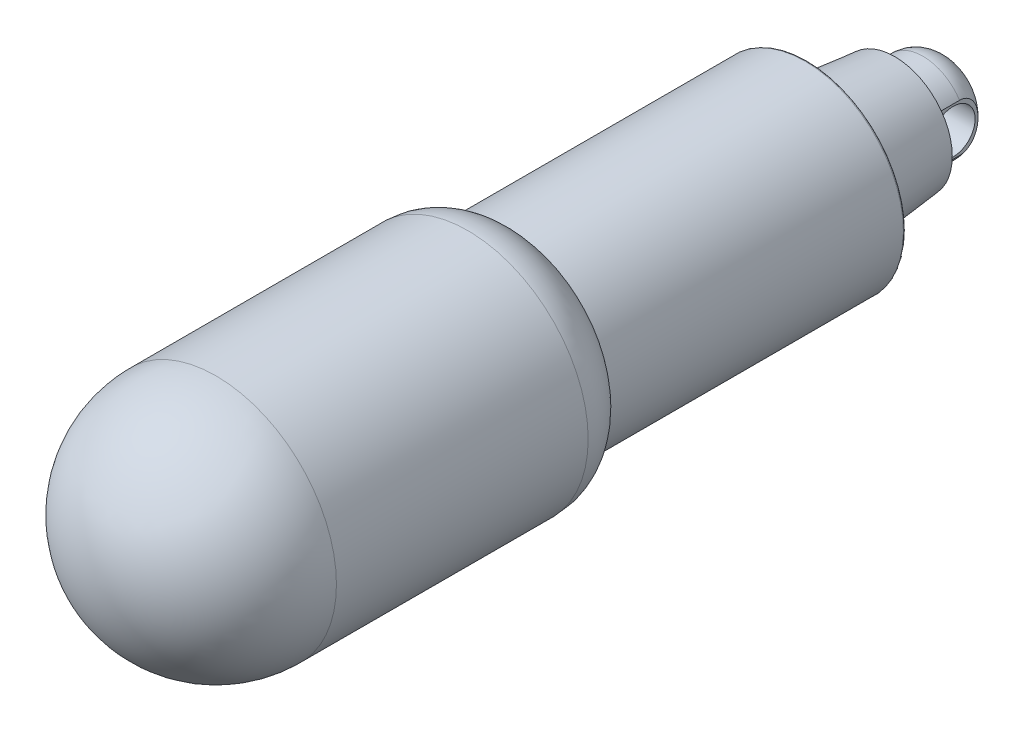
ISO-10303-21;
HEADER;
FILE_DESCRIPTION(('STEP AP214'),'2;1');
FILE_NAME('part.step','',(''),(''),'','','');
FILE_SCHEMA(('AUTOMOTIVE_DESIGN { 1 0 10303 214 1 1 1 1 }'));
ENDSEC;
DATA;
#1=APPLICATION_CONTEXT('core data for automotive mechanical design processes');
#2=APPLICATION_PROTOCOL_DEFINITION('international standard','automotive_design',2000,#1);
#3=PRODUCT_CONTEXT('',#1,'mechanical');
#4=PRODUCT('Part','Part','',(#3));
#5=PRODUCT_RELATED_PRODUCT_CATEGORY('part','',(#4));
#6=PRODUCT_DEFINITION_FORMATION('','',#4);
#7=PRODUCT_DEFINITION_CONTEXT('part definition',#1,'design');
#8=PRODUCT_DEFINITION('design','',#6,#7);
#9=PRODUCT_DEFINITION_SHAPE('','',#8);
#10=(LENGTH_UNIT() NAMED_UNIT(*) SI_UNIT(.MILLI.,.METRE.));
#11=(NAMED_UNIT(*) PLANE_ANGLE_UNIT() SI_UNIT($,.RADIAN.));
#12=(NAMED_UNIT(*) SI_UNIT($,.STERADIAN.) SOLID_ANGLE_UNIT());
#13=UNCERTAINTY_MEASURE_WITH_UNIT(LENGTH_MEASURE(1.E-05),#10,'distance_accuracy_value','');
#14=(GEOMETRIC_REPRESENTATION_CONTEXT(3) GLOBAL_UNCERTAINTY_ASSIGNED_CONTEXT((#13)) GLOBAL_UNIT_ASSIGNED_CONTEXT((#10,
#11,#12)) REPRESENTATION_CONTEXT('',''));
#15=CARTESIAN_POINT('',(0.,0.,0.));
#16=DIRECTION('',(0.,0.,1.));
#17=DIRECTION('',(1.,0.,0.));
#18=AXIS2_PLACEMENT_3D('',#15,#16,#17);
#19=CARTESIAN_POINT('',(0.,0.,64.));
#20=DIRECTION('',(1.,0.,0.));
#21=DIRECTION('',(0.,1.,0.));
#22=AXIS2_PLACEMENT_3D('',#19,#20,#21);
#23=SPHERICAL_SURFACE('',#22,11.);
#24=CARTESIAN_POINT('',(0.,0.,64.));
#25=DIRECTION('',(0.,0.,1.));
#26=DIRECTION('',(0.,1.,0.));
#27=AXIS2_PLACEMENT_3D('',#24,#25,#26);
#28=SPHERICAL_SURFACE('',#27,11.);
#29=CARTESIAN_POINT('',(0.,0.,64.));
#30=DIRECTION('',(0.,0.,1.));
#31=DIRECTION('',(0.,1.,0.));
#32=AXIS2_PLACEMENT_3D('',#29,#30,#31);
#33=CIRCLE('',#32,11.);
#34=CARTESIAN_POINT('',(0.,-11.,64.));
#35=VERTEX_POINT('',#34);
#36=CARTESIAN_POINT('',(11.,0.,64.));
#37=VERTEX_POINT('',#36);
#38=EDGE_CURVE('E9',#35,#37,#33,.T.);
#39=ORIENTED_EDGE('',*,*,#38,.T.);
#40=CARTESIAN_POINT('',(0.,0.,64.));
#41=DIRECTION('',(0.,0.,1.));
#42=DIRECTION('',(0.,1.,0.));
#43=AXIS2_PLACEMENT_3D('',#40,#41,#42);
#44=CIRCLE('',#43,11.);
#45=CARTESIAN_POINT('',(-11.,0.,64.));
#46=VERTEX_POINT('',#45);
#47=EDGE_CURVE('E26',#37,#46,#44,.T.);
#48=ORIENTED_EDGE('',*,*,#47,.T.);
#49=CARTESIAN_POINT('',(0.,0.,64.));
#50=DIRECTION('',(0.,0.,1.));
#51=DIRECTION('',(0.,1.,0.));
#52=AXIS2_PLACEMENT_3D('',#49,#50,#51);
#53=CIRCLE('',#52,11.);
#54=EDGE_CURVE('E322',#46,#35,#53,.T.);
#55=ORIENTED_EDGE('',*,*,#54,.T.);
#56=EDGE_LOOP('',(#39,#48,#55));
#57=FACE_BOUND('',#56,.T.);
#58=ADVANCED_FACE('F14',(#57),#28,.T.);
#59=CARTESIAN_POINT('',(0.,0.,52.5));
#60=DIRECTION('',(0.,0.,-1.));
#61=DIRECTION('',(0.,1.,0.));
#62=AXIS2_PLACEMENT_3D('',#59,#60,#61);
#63=CYLINDRICAL_SURFACE('',#62,11.);
#64=ORIENTED_EDGE('',*,*,#38,.F.);
#65=ORIENTED_EDGE('',*,*,#54,.F.);
#66=ORIENTED_EDGE('',*,*,#47,.F.);
#67=EDGE_LOOP('',(#64,#65,#66));
#68=FACE_BOUND('',#67,.T.);
#69=CARTESIAN_POINT('',(0.,0.,41.));
#70=DIRECTION('',(0.,0.,1.));
#71=DIRECTION('',(0.,1.,0.));
#72=AXIS2_PLACEMENT_3D('',#69,#70,#71);
#73=CIRCLE('',#72,11.);
#74=CARTESIAN_POINT('',(11.,0.,41.));
#75=VERTEX_POINT('',#74);
#76=EDGE_CURVE('E319',#75,#75,#73,.T.);
#77=ORIENTED_EDGE('',*,*,#76,.T.);
#78=EDGE_LOOP('',(#77));
#79=FACE_BOUND('',#78,.T.);
#80=ADVANCED_FACE('F260',(#68,#79),#63,.T.);
#81=CARTESIAN_POINT('',(0.,0.,41.));
#82=DIRECTION('',(0.,0.,1.));
#83=DIRECTION('',(0.707106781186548,0.707106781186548,0.));
#84=AXIS2_PLACEMENT_3D('',#81,#82,#83);
#85=TOROIDAL_SURFACE('',#84,6.,5.);
#86=ORIENTED_EDGE('',*,*,#76,.F.);
#87=EDGE_LOOP('',(#86));
#88=FACE_BOUND('',#87,.T.);
#89=CARTESIAN_POINT('',(0.,0.,37.));
#90=DIRECTION('',(0.,0.,1.));
#91=DIRECTION('',(0.,1.,0.));
#92=AXIS2_PLACEMENT_3D('',#89,#90,#91);
#93=CIRCLE('',#92,9.);
#94=CARTESIAN_POINT('',(0.,-9.,37.));
#95=VERTEX_POINT('',#94);
#96=EDGE_CURVE('E316',#95,#95,#93,.T.);
#97=ORIENTED_EDGE('',*,*,#96,.T.);
#98=EDGE_LOOP('',(#97));
#99=FACE_BOUND('',#98,.T.);
#100=ADVANCED_FACE('F266',(#88,#99),#85,.T.);
#101=CARTESIAN_POINT('',(0.,0.,23.6));
#102=DIRECTION('',(0.,0.,-1.));
#103=DIRECTION('',(0.,1.,0.));
#104=AXIS2_PLACEMENT_3D('',#101,#102,#103);
#105=CYLINDRICAL_SURFACE('',#104,9.);
#106=ORIENTED_EDGE('',*,*,#96,.F.);
#107=EDGE_LOOP('',(#106));
#108=FACE_BOUND('',#107,.T.);
#109=CARTESIAN_POINT('',(0.,0.,10.2));
#110=DIRECTION('',(0.,0.,1.));
#111=DIRECTION('',(0.,1.,0.));
#112=AXIS2_PLACEMENT_3D('',#109,#110,#111);
#113=CIRCLE('',#112,9.);
#114=CARTESIAN_POINT('',(9.,0.,10.2));
#115=VERTEX_POINT('',#114);
#116=EDGE_CURVE('E313',#115,#115,#113,.T.);
#117=ORIENTED_EDGE('',*,*,#116,.T.);
#118=EDGE_LOOP('',(#117));
#119=FACE_BOUND('',#118,.T.);
#120=ADVANCED_FACE('F272',(#108,#119),#105,.T.);
#121=CARTESIAN_POINT('',(0.,0.,10.2));
#122=DIRECTION('',(0.,0.,1.));
#123=DIRECTION('',(0.707106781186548,0.707106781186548,0.));
#124=AXIS2_PLACEMENT_3D('',#121,#122,#123);
#125=TOROIDAL_SURFACE('',#124,8.8,0.2);
#126=ORIENTED_EDGE('',*,*,#116,.F.);
#127=EDGE_LOOP('',(#126));
#128=FACE_BOUND('',#127,.T.);
#129=CARTESIAN_POINT('',(0.,0.,10.));
#130=DIRECTION('',(0.,0.,1.));
#131=DIRECTION('',(0.,1.,0.));
#132=AXIS2_PLACEMENT_3D('',#129,#130,#131);
#133=CIRCLE('',#132,8.8);
#134=CARTESIAN_POINT('',(0.,8.8,10.));
#135=VERTEX_POINT('',#134);
#136=EDGE_CURVE('E308',#135,#135,#133,.T.);
#137=ORIENTED_EDGE('',*,*,#136,.T.);
#138=EDGE_LOOP('',(#137));
#139=FACE_BOUND('',#138,.T.);
#140=ADVANCED_FACE('F276',(#128,#139),#125,.T.);
#141=CARTESIAN_POINT('',(0.,0.,9.5));
#142=DIRECTION('',(0.,0.,-1.));
#143=DIRECTION('',(0.,1.,0.));
#144=AXIS2_PLACEMENT_3D('',#141,#142,#143);
#145=CYLINDRICAL_SURFACE('',#144,7.15);
#146=CARTESIAN_POINT('',(0.,0.,10.));
#147=DIRECTION('',(0.,0.,1.));
#148=DIRECTION('',(0.,1.,0.));
#149=AXIS2_PLACEMENT_3D('',#146,#147,#148);
#150=CIRCLE('',#149,7.15);
#151=CARTESIAN_POINT('',(0.,-7.15,10.));
#152=VERTEX_POINT('',#151);
#153=EDGE_CURVE('E305',#152,#152,#150,.T.);
#154=ORIENTED_EDGE('',*,*,#153,.F.);
#155=EDGE_LOOP('',(#154));
#156=FACE_BOUND('',#155,.T.);
#157=CARTESIAN_POINT('',(0.,0.,9.));
#158=DIRECTION('',(0.,0.,1.));
#159=DIRECTION('',(0.,1.,0.));
#160=AXIS2_PLACEMENT_3D('',#157,#158,#159);
#161=CIRCLE('',#160,7.15);
#162=CARTESIAN_POINT('',(0.,-7.15,9.));
#163=VERTEX_POINT('',#162);
#164=EDGE_CURVE('E300',#163,#163,#161,.T.);
#165=ORIENTED_EDGE('',*,*,#164,.T.);
#166=EDGE_LOOP('',(#165));
#167=FACE_BOUND('',#166,.T.);
#168=ADVANCED_FACE('F280',(#156,#167),#145,.T.);
#169=CARTESIAN_POINT('',(0.,0.,8.6));
#170=DIRECTION('',(0.,0.,1.));
#171=DIRECTION('',(0.707106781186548,0.707106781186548,0.));
#172=AXIS2_PLACEMENT_3D('',#169,#170,#171);
#173=TOROIDAL_SURFACE('',#172,6.36016161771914,0.4);
#174=CARTESIAN_POINT('',(0.,0.,9.));
#175=DIRECTION('',(0.,0.,1.));
#176=DIRECTION('',(0.,1.,0.));
#177=AXIS2_PLACEMENT_3D('',#174,#175,#176);
#178=CIRCLE('',#177,6.36016161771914);
#179=CARTESIAN_POINT('',(0.,6.36016161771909,9.));
#180=VERTEX_POINT('',#179);
#181=EDGE_CURVE('E121',#180,#180,#178,.T.);
#182=ORIENTED_EDGE('',*,*,#181,.F.);
#183=EDGE_LOOP('',(#182));
#184=FACE_BOUND('',#183,.T.);
#185=CARTESIAN_POINT('',(0.,0.,8.64181138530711));
#186=DIRECTION('',(0.,0.,1.));
#187=DIRECTION('',(0.,1.,0.));
#188=AXIS2_PLACEMENT_3D('',#185,#186,#187);
#189=CIRCLE('',#188,5.96235285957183);
#190=CARTESIAN_POINT('',(0.,-5.9623528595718,8.64181138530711));
#191=VERTEX_POINT('',#190);
#192=EDGE_CURVE('E297',#191,#191,#189,.T.);
#193=ORIENTED_EDGE('',*,*,#192,.T.);
#194=EDGE_LOOP('',(#193));
#195=FACE_BOUND('',#194,.T.);
#196=ADVANCED_FACE('F284',(#184,#195),#173,.F.);
#197=CARTESIAN_POINT('',(0.,0.,5.32090569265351));
#198=DIRECTION('',(0.,0.,1.));
#199=DIRECTION('',(0.,1.,0.));
#200=AXIS2_PLACEMENT_3D('',#197,#198,#199);
#201=CONICAL_SURFACE('',#200,5.61331160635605,0.10471975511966);
#202=ORIENTED_EDGE('',*,*,#192,.F.);
#203=EDGE_LOOP('',(#202));
#204=FACE_BOUND('',#203,.T.);
#205=CARTESIAN_POINT('',(0.,0.,2.));
#206=DIRECTION('',(0.,0.,1.));
#207=DIRECTION('',(0.,1.,0.));
#208=AXIS2_PLACEMENT_3D('',#205,#206,#207);
#209=CIRCLE('',#208,5.26427035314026);
#210=CARTESIAN_POINT('',(3.35,4.0607933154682,2.));
#211=VERTEX_POINT('',#210);
#212=EDGE_CURVE('E145',#211,#211,#209,.T.);
#213=ORIENTED_EDGE('',*,*,#212,.T.);
#214=EDGE_LOOP('',(#213));
#215=FACE_BOUND('',#214,.T.);
#216=ADVANCED_FACE('F287',(#204,#215),#201,.T.);
#217=CARTESIAN_POINT('',(0.,0.,0.708333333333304));
#218=DIRECTION('',(0.,0.,-1.));
#219=DIRECTION('',(0.,1.,0.));
#220=AXIS2_PLACEMENT_3D('',#217,#218,#219);
#221=CYLINDRICAL_SURFACE('',#220,4.);
#222=CARTESIAN_POINT('',(0.,0.,2.));
#223=DIRECTION('',(0.,0.,1.));
#224=DIRECTION('',(0.,1.,0.));
#225=AXIS2_PLACEMENT_3D('',#222,#223,#224);
#226=CIRCLE('',#225,4.);
#227=CARTESIAN_POINT('',(-3.35,-2.1857492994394,2.));
#228=VERTEX_POINT('',#227);
#229=CARTESIAN_POINT('',(3.35,-2.1857492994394,2.));
#230=VERTEX_POINT('',#229);
#231=EDGE_CURVE('E134',#228,#230,#226,.T.);
#232=ORIENTED_EDGE('',*,*,#231,.F.);
#233=DIRECTION('',(0.,0.,-1.));
#234=VECTOR('',#233,1.);
#235=CARTESIAN_POINT('',(-3.35,-2.1857492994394,2.));
#236=LINE('',#235,#234);
#237=CARTESIAN_POINT('',(-3.35,-2.1857492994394,-0.583333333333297));
#238=VERTEX_POINT('',#237);
#239=EDGE_CURVE('E139',#228,#238,#236,.T.);
#240=ORIENTED_EDGE('',*,*,#239,.T.);
#241=CARTESIAN_POINT('',(0.,0.,-0.583333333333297));
#242=DIRECTION('',(0.,0.,1.));
#243=DIRECTION('',(0.,1.,0.));
#244=AXIS2_PLACEMENT_3D('',#241,#242,#243);
#245=CIRCLE('',#244,4.);
#246=CARTESIAN_POINT('',(3.35,-2.1857492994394,-0.583333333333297));
#247=VERTEX_POINT('',#246);
#248=EDGE_CURVE('E136',#238,#247,#245,.T.);
#249=ORIENTED_EDGE('',*,*,#248,.T.);
#250=DIRECTION('',(0.,0.,1.));
#251=VECTOR('',#250,1.);
#252=CARTESIAN_POINT('',(3.35,-2.1857492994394,-0.583333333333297));
#253=LINE('',#252,#251);
#254=EDGE_CURVE('E140',#247,#230,#253,.T.);
#255=ORIENTED_EDGE('',*,*,#254,.T.);
#256=EDGE_LOOP('',(#232,#240,#249,#255));
#257=FACE_BOUND('',#256,.T.);
#258=ADVANCED_FACE('F187',(#257),#221,.T.);
#259=CARTESIAN_POINT('',(0.,0.,-0.583333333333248));
#260=DIRECTION('',(0.,0.,1.));
#261=DIRECTION('',(0.707106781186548,0.707106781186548,0.));
#262=AXIS2_PLACEMENT_3D('',#259,#260,#261);
#263=DEGENERATE_TOROIDAL_SURFACE('',#262,1.49999999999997,2.5,.T.);
#264=CARTESIAN_POINT('',(3.34999999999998,0.,-2.26485050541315));
#265=CARTESIAN_POINT('',(3.3500009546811,-0.0318576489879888,-2.2648488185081));
#266=CARTESIAN_POINT('',(3.35001074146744,-0.0637157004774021,-2.2643386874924));
#267=CARTESIAN_POINT('',(3.35005354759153,-0.12728788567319,-2.26229431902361));
#268=CARTESIAN_POINT('',(3.35008648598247,-0.159002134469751,-2.2607636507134));
#269=CARTESIAN_POINT('',(3.35018105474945,-0.222339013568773,-2.25667273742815));
#270=CARTESIAN_POINT('',(3.35024266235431,-0.253961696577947,-2.25411330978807));
#271=CARTESIAN_POINT('',(3.35038878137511,-0.317165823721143,-2.24795677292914));
#272=CARTESIAN_POINT('',(3.35047333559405,-0.348747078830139,-2.24435772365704));
#273=CARTESIAN_POINT('',(3.35065217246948,-0.4119161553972,-2.23610846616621));
#274=CARTESIAN_POINT('',(3.35074649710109,-0.443503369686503,-2.23145361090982));
#275=CARTESIAN_POINT('',(3.35092155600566,-0.506729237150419,-2.22107702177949));
#276=CARTESIAN_POINT('',(3.35100219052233,-0.538366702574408,-2.2153480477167));
#277=CARTESIAN_POINT('',(3.35112523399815,-0.601731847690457,-2.20279595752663));
#278=CARTESIAN_POINT('',(3.35116727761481,-0.633457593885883,-2.19596309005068));
#279=CARTESIAN_POINT('',(3.35115594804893,-0.697039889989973,-2.18119977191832));
#280=CARTESIAN_POINT('',(3.35110146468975,-0.728893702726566,-2.17325753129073));
#281=CARTESIAN_POINT('',(3.3509300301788,-0.79163901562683,-2.1564577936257));
#282=CARTESIAN_POINT('',(3.35081442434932,-0.822536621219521,-2.14762320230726));
#283=CARTESIAN_POINT('',(3.35061183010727,-0.88373820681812,-2.12885500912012));
#284=CARTESIAN_POINT('',(3.35052462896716,-0.914044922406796,-2.11893035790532));
#285=CARTESIAN_POINT('',(3.35036880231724,-0.974081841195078,-2.09797391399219));
#286=CARTESIAN_POINT('',(3.35030007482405,-1.0038143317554,-2.08694868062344));
#287=CARTESIAN_POINT('',(3.35018991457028,-1.06270624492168,-2.06375360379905));
#288=CARTESIAN_POINT('',(3.35014838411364,-1.09186734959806,-2.05158803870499));
#289=CARTESIAN_POINT('',(3.35008909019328,-1.14961513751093,-2.02608073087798));
#290=CARTESIAN_POINT('',(3.35007128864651,-1.1782026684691,-2.01274090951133));
#291=CARTESIAN_POINT('',(3.35005216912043,-1.23479444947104,-1.98485076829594));
#292=CARTESIAN_POINT('',(3.35005085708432,-1.26279848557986,-1.97030001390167));
#293=CARTESIAN_POINT('',(3.35005241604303,-1.31820690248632,-1.93995310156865));
#294=CARTESIAN_POINT('',(3.35005529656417,-1.34560977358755,-1.92415418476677));
#295=CARTESIAN_POINT('',(3.35004630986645,-1.39979295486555,-1.89127807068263));
#296=CARTESIAN_POINT('',(3.35003438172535,-1.42657022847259,-1.87419586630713));
#297=CARTESIAN_POINT('',(3.34997918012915,-1.47974116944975,-1.83852903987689));
#298=CARTESIAN_POINT('',(3.34993539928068,-1.50612148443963,-1.81992447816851));
#299=CARTESIAN_POINT('',(3.3498440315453,-1.55770794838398,-1.78158868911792));
#300=CARTESIAN_POINT('',(3.34979647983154,-1.58292211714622,-1.76186827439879));
#301=CARTESIAN_POINT('',(3.34971353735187,-1.63213054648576,-1.72128229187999));
#302=CARTESIAN_POINT('',(3.34967806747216,-1.65613183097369,-1.70042525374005));
#303=CARTESIAN_POINT('',(3.34963202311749,-1.70286322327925,-1.65754802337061));
#304=CARTESIAN_POINT('',(3.34962133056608,-1.72559885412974,-1.63553386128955));
#305=CARTESIAN_POINT('',(3.34963156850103,-1.76974336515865,-1.59032899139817));
#306=CARTESIAN_POINT('',(3.34965241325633,-1.79115567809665,-1.56714163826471));
#307=CARTESIAN_POINT('',(3.34972700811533,-1.83259591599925,-1.51957751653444));
#308=CARTESIAN_POINT('',(3.34978074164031,-1.85262453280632,-1.49520135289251));
#309=CARTESIAN_POINT('',(3.3498819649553,-1.88156289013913,-1.45776651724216));
#310=CARTESIAN_POINT('',(3.34991917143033,-1.89103020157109,-1.4451353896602));
#311=CARTESIAN_POINT('',(3.34999946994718,-1.90959450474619,-1.41957382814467));
#312=CARTESIAN_POINT('',(3.3500425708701,-1.91869091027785,-1.40664296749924));
#313=CARTESIAN_POINT('',(3.35013192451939,-1.93650582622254,-1.38048299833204));
#314=CARTESIAN_POINT('',(3.35017818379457,-1.94522348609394,-1.36725331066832));
#315=CARTESIAN_POINT('',(3.35027607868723,-1.96226696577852,-1.34049247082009));
#316=CARTESIAN_POINT('',(3.3503277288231,-1.97059163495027,-1.32696058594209));
#317=CARTESIAN_POINT('',(3.35041930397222,-1.98711678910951,-1.29917634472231));
#318=CARTESIAN_POINT('',(3.35045875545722,-1.99530273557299,-1.28491534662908));
#319=CARTESIAN_POINT('',(3.35051187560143,-2.01118452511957,-1.25624838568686));
#320=CARTESIAN_POINT('',(3.3505257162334,-2.01888329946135,-1.24184404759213));
#321=CARTESIAN_POINT('',(3.35053741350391,-2.03377918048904,-1.21289089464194));
#322=CARTESIAN_POINT('',(3.35053536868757,-2.0409791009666,-1.19834352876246));
#323=CARTESIAN_POINT('',(3.35051891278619,-2.05487306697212,-1.1691090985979));
#324=CARTESIAN_POINT('',(3.3505045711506,-2.06156972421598,-1.15442327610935));
#325=CARTESIAN_POINT('',(3.35046808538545,-2.07445133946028,-1.12491578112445));
#326=CARTESIAN_POINT('',(3.35044598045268,-2.08063867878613,-1.11009514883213));
#327=CARTESIAN_POINT('',(3.35039756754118,-2.09249659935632,-1.08032233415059));
#328=CARTESIAN_POINT('',(3.35037127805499,-2.0981692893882,-1.06537099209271));
#329=CARTESIAN_POINT('',(3.35031761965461,-2.10899298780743,-1.03534113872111));
#330=CARTESIAN_POINT('',(3.35029025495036,-2.11414579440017,-1.02026327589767));
#331=CARTESIAN_POINT('',(3.35023694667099,-2.12392510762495,-0.989984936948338));
#332=CARTESIAN_POINT('',(3.35021099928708,-2.12855306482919,-0.97478492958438));
#333=CARTESIAN_POINT('',(3.35016242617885,-2.13727832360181,-0.944267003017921));
#334=CARTESIAN_POINT('',(3.35013979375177,-2.14137669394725,-0.928949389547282));
#335=CARTESIAN_POINT('',(3.35009913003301,-2.14903870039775,-0.898201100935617));
#336=CARTESIAN_POINT('',(3.3500810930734,-2.15260299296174,-0.882770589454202));
#337=CARTESIAN_POINT('',(3.3500502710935,-2.15919304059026,-0.851801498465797));
#338=CARTESIAN_POINT('',(3.35003748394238,-2.16221901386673,-0.836262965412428));
#339=CARTESIAN_POINT('',(3.35001717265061,-2.1677289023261,-0.805082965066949));
#340=CARTESIAN_POINT('',(3.35000965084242,-2.17021257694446,-0.789441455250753));
#341=CARTESIAN_POINT('',(3.3499992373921,-2.17463461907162,-0.758060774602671));
#342=CARTESIAN_POINT('',(3.34999635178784,-2.17657227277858,-0.742321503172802));
#343=CARTESIAN_POINT('',(3.3499939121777,-2.17989935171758,-0.710750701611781));
#344=CARTESIAN_POINT('',(3.34999436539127,-2.18128758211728,-0.694919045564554));
#345=CARTESIAN_POINT('',(3.3499966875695,-2.18351302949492,-0.663169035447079));
#346=CARTESIAN_POINT('',(3.34999856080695,-2.18434856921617,-0.647250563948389));
#347=CARTESIAN_POINT('',(3.35000098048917,-2.18546672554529,-0.615332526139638));
#348=CARTESIAN_POINT('',(3.3500015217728,-2.18574719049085,-0.599332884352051));
#349=CARTESIAN_POINT('',(3.34999999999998,-2.18574929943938,-0.583333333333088));
#350=B_SPLINE_CURVE_WITH_KNOTS('',3,(#264,#265,#266,#267,#268,#269,#270,#271,#272,#273,#274,
#275,#276,#277,#278,#279,#280,#281,#282,#283,#284,#285,#286,#287,#288,#289,#290,#291,#292,#293,
#294,#295,#296,#297,#298,#299,#300,#301,#302,#303,#304,#305,#306,#307,#308,#309,#310,#311,#312,
#313,#314,#315,#316,#317,#318,#319,#320,#321,#322,#323,#324,#325,#326,#327,#328,#329,#330,#331,
#332,#333,#334,#335,#336,#337,#338,#339,#340,#341,#342,#343,#344,#345,#346,#347,#348,#349),
.UNSPECIFIED.,.F.,.F.,(4,2,2,2,2,2,2,2,2,2,2,2,2,2,2,2,2,2,2,2,2,2,2,2,2,2,2,2,2,2,2,2,2,2,2,2,
2,2,2,2,2,2,4),(0.,0.0955695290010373,0.190806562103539,0.285968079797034,0.381308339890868,
0.477076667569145,0.573515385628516,0.670857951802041,0.769327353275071,0.865714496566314,
0.961362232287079,1.05647056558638,1.1512353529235,1.24584786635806,1.34049447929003,
1.43535648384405,1.53061004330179,1.62741510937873,1.72340459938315,1.81875287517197,
1.91364582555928,2.0082812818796,2.10286907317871,2.15021917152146,2.19764141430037,
2.24516516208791,2.29282037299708,2.34214313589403,2.39113348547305,2.43982016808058,
2.48823367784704,2.53640618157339,2.58437142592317,2.63216462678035,2.67982234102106,
2.72738232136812,2.77488335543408,2.82236509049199,2.86986784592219,2.91743241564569,
2.96509986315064,3.01291131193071,3.06090773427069),.UNSPECIFIED.);
#351=CARTESIAN_POINT('',(3.35,0.,-2.2648505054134));
#352=VERTEX_POINT('',#351);
#353=EDGE_CURVE('E150',#352,#247,#350,.T.);
#354=ORIENTED_EDGE('',*,*,#353,.T.);
#355=ORIENTED_EDGE('',*,*,#248,.F.);
#356=CARTESIAN_POINT('',(-3.34999999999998,-2.18574929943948,-0.583333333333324));
#357=CARTESIAN_POINT('',(-3.35000152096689,-2.1857471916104,-0.59932776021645));
#358=CARTESIAN_POINT('',(-3.35000106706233,-2.18546677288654,-0.615322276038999));
#359=CARTESIAN_POINT('',(-3.34999896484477,-2.18434882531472,-0.647230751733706));
#360=CARTESIAN_POINT('',(-3.34999732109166,-2.183513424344,-0.663144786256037));
#361=CARTESIAN_POINT('',(-3.34999556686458,-2.18128834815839,-0.694886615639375));
#362=CARTESIAN_POINT('',(-3.34999545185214,-2.17990032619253,-0.710714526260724));
#363=CARTESIAN_POINT('',(-3.34999864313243,-2.17657373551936,-0.742278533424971));
#364=CARTESIAN_POINT('',(-3.35000194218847,-2.17463633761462,-0.758014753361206));
#365=CARTESIAN_POINT('',(-3.35001322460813,-2.17021485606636,-0.789390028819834));
#366=CARTESIAN_POINT('',(-3.35002120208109,-2.16773146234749,-0.805029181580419));
#367=CARTESIAN_POINT('',(-3.35004243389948,-2.1622221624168,-0.836205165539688));
#368=CARTESIAN_POINT('',(-3.35005568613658,-2.15919647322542,-0.851742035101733));
#369=CARTESIAN_POINT('',(-3.35008741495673,-2.15260699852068,-0.882708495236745));
#370=CARTESIAN_POINT('',(-3.35010589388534,-2.14904297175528,-0.898138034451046));
#371=CARTESIAN_POINT('',(-3.35014738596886,-2.14138148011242,-0.928885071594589));
#372=CARTESIAN_POINT('',(-3.35017040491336,-2.13728333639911,-0.944202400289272));
#373=CARTESIAN_POINT('',(-3.35021966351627,-2.12855849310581,-0.97472044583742));
#374=CARTESIAN_POINT('',(-3.35024590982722,-2.12393070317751,-0.98992085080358));
#375=CARTESIAN_POINT('',(-3.35029969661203,-2.11415166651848,-1.02020066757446));
#376=CARTESIAN_POINT('',(-3.35032724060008,-2.10899894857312,-1.0352796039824));
#377=CARTESIAN_POINT('',(-3.35038110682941,-2.09817534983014,-1.06531227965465));
#378=CARTESIAN_POINT('',(-3.35040742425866,-2.09250265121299,-1.08026536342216));
#379=CARTESIAN_POINT('',(-3.35045571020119,-2.08064461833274,-1.11004232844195));
#380=CARTESIAN_POINT('',(-3.35047765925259,-2.07445715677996,-1.12486536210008));
#381=CARTESIAN_POINT('',(-3.35051362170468,-2.06157518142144,-1.15437831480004));
#382=CARTESIAN_POINT('',(-3.35052759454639,-2.05487826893,-1.16906718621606));
#383=CARTESIAN_POINT('',(-3.35054306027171,-2.04098367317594,-1.19830836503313));
#384=CARTESIAN_POINT('',(-3.35054448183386,-2.03378336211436,-1.21285942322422));
#385=CARTESIAN_POINT('',(-3.35053129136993,-2.01888651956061,-1.24182057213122));
#386=CARTESIAN_POINT('',(-3.35051657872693,-2.01118715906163,-1.25622920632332));
#387=CARTESIAN_POINT('',(-3.35046129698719,-1.99530417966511,-1.28490545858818));
#388=CARTESIAN_POINT('',(-3.35042055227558,-1.98711761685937,-1.29917144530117));
#389=CARTESIAN_POINT('',(-3.35032656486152,-1.97059824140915,-1.32695286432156));
#390=CARTESIAN_POINT('',(-3.35027380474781,-1.96228035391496,-1.34047716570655));
#391=CARTESIAN_POINT('',(-3.35017423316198,-1.94524954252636,-1.36722387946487));
#392=CARTESIAN_POINT('',(-3.35012740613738,-1.93653773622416,-1.38044700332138));
#393=CARTESIAN_POINT('',(-3.3500372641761,-1.91873376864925,-1.40659497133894));
#394=CARTESIAN_POINT('',(-3.34999394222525,-1.90964242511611,-1.4195203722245));
#395=CARTESIAN_POINT('',(-3.34991351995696,-1.89108741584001,-1.44507210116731));
#396=CARTESIAN_POINT('',(-3.34987641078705,-1.88162430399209,-1.45769883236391));
#397=CARTESIAN_POINT('',(-3.34977584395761,-1.85269603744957,-1.49512370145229));
#398=CARTESIAN_POINT('',(-3.3497230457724,-1.83267309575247,-1.51949416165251));
#399=CARTESIAN_POINT('',(-3.34965078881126,-1.79124078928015,-1.56705114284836));
#400=CARTESIAN_POINT('',(-3.34963135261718,-1.7698304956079,-1.59023685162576));
#401=CARTESIAN_POINT('',(-3.34962388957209,-1.72568646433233,-1.63544254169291));
#402=CARTESIAN_POINT('',(-3.34963595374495,-1.70294907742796,-1.65745895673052));
#403=CARTESIAN_POINT('',(-3.34968413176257,-1.65621056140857,-1.70034469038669));
#404=CARTESIAN_POINT('',(-3.34972036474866,-1.63220371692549,-1.72120776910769));
#405=CARTESIAN_POINT('',(-3.3498038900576,-1.58298038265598,-1.761809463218));
#406=CARTESIAN_POINT('',(-3.34985125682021,-1.55775670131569,-1.78153934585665));
#407=CARTESIAN_POINT('',(-3.34994011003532,-1.5061479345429,-1.81989825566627));
#408=CARTESIAN_POINT('',(-3.34998154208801,-1.47975469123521,-1.83851628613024));
#409=CARTESIAN_POINT('',(-3.35003202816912,-1.42658794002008,-1.87418760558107));
#410=CARTESIAN_POINT('',(-3.35004162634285,-1.39982876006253,-1.89126228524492));
#411=CARTESIAN_POINT('',(-3.35004809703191,-1.34567635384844,-1.92412542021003));
#412=CARTESIAN_POINT('',(-3.35004501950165,-1.31828603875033,-1.93991867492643));
#413=CARTESIAN_POINT('',(-3.35004399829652,-1.26289779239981,-1.97025697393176));
#414=CARTESIAN_POINT('',(-3.35004604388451,-1.23490125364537,-1.98480456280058));
#415=CARTESIAN_POINT('',(-3.35006722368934,-1.17831941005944,-2.01269079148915));
#416=CARTESIAN_POINT('',(-3.35008635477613,-1.14973421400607,-2.026029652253));
#417=CARTESIAN_POINT('',(-3.35014835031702,-1.09198610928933,-2.05153740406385));
#418=CARTESIAN_POINT('',(-3.35019125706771,-1.06282226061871,-2.06370416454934));
#419=CARTESIAN_POINT('',(-3.35030368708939,-1.00391993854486,-2.08690393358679));
#420=CARTESIAN_POINT('',(-3.35037331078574,-0.974179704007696,-2.09793246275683));
#421=CARTESIAN_POINT('',(-3.35053008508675,-0.91412242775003,-2.11889757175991));
#422=CARTESIAN_POINT('',(-3.35061733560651,-0.883803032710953,-2.12882740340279));
#423=CARTESIAN_POINT('',(-3.35081820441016,-0.822571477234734,-2.14760851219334));
#424=CARTESIAN_POINT('',(-3.35093202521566,-0.791656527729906,-2.15645066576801));
#425=CARTESIAN_POINT('',(-3.35109935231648,-0.728903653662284,-2.17325735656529));
#426=CARTESIAN_POINT('',(-3.35115156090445,-0.69705987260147,-2.18119993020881));
#427=CARTESIAN_POINT('',(-3.3511598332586,-0.633494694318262,-2.1959635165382));
#428=CARTESIAN_POINT('',(-3.35111698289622,-0.601776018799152,-2.20279624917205));
#429=CARTESIAN_POINT('',(-3.35099303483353,-0.53842221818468,-2.2153482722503));
#430=CARTESIAN_POINT('',(-3.3509122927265,-0.506789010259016,-2.22107723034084));
#431=CARTESIAN_POINT('',(-3.3507376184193,-0.443568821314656,-2.23145383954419));
#432=CARTESIAN_POINT('',(-3.35064378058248,-0.411983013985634,-2.23610864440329));
#433=CARTESIAN_POINT('',(-3.35046623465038,-0.348813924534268,-2.24435789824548));
#434=CARTESIAN_POINT('',(-3.35038248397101,-0.3172312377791,-2.24795690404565));
#435=CARTESIAN_POINT('',(-3.35023805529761,-0.254021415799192,-2.25411344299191));
#436=CARTESIAN_POINT('',(-3.35017733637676,-0.222394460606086,-2.25667282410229));
#437=CARTESIAN_POINT('',(-3.35008438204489,-0.159046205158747,-2.26076373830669));
#438=CARTESIAN_POINT('',(-3.35005217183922,-0.127324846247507,-2.26229436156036));
#439=CARTESIAN_POINT('',(-3.35001041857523,-0.0637355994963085,-2.26433873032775));
#440=CARTESIAN_POINT('',(-3.35000095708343,-0.0318675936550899,-2.26484881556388));
#441=CARTESIAN_POINT('',(-3.34999999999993,0.,-2.26485050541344));
#442=B_SPLINE_CURVE_WITH_KNOTS('',3,(#356,#357,#358,#359,#360,#361,#362,#363,#364,#365,#366,
#367,#368,#369,#370,#371,#372,#373,#374,#375,#376,#377,#378,#379,#380,#381,#382,#383,#384,#385,
#386,#387,#388,#389,#390,#391,#392,#393,#394,#395,#396,#397,#398,#399,#400,#401,#402,#403,#404,
#405,#406,#407,#408,#409,#410,#411,#412,#413,#414,#415,#416,#417,#418,#419,#420,#421,#422,#423,
#424,#425,#426,#427,#428,#429,#430,#431,#432,#433,#434,#435,#436,#437,#438,#439,#440,#441),
.UNSPECIFIED.,.F.,.F.,(4,2,2,2,2,2,2,2,2,2,2,2,2,2,2,2,2,2,2,2,2,2,2,2,2,2,2,2,2,2,2,2,2,2,2,2,
2,2,2,2,2,2,4),(0.,0.0479810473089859,0.0957791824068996,0.14343538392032,0.190990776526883,
0.238486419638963,0.285963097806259,0.333461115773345,0.381020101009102,0.428678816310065,
0.476474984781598,0.52444512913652,0.572624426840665,0.621046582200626,0.669743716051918,
0.718746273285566,0.768082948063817,0.815708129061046,0.863205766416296,0.910605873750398,
0.957937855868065,1.05250158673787,1.14712930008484,1.24203075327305,1.33740351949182,
1.43343305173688,1.53029311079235,1.62548873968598,1.72030956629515,1.81493183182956,
1.90953676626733,2.00431054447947,2.09944411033,2.19513287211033,2.29157627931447,
2.39001669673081,2.48733841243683,2.58376454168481,2.67952865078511,2.77487314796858,
2.87004741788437,2.96530575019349,3.06090512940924),.UNSPECIFIED.);
#443=CARTESIAN_POINT('',(-3.35,0.,-2.2648505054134));
#444=VERTEX_POINT('',#443);
#445=EDGE_CURVE('E239',#238,#444,#442,.T.);
#446=ORIENTED_EDGE('',*,*,#445,.T.);
#447=CARTESIAN_POINT('',(-3.34999999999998,0.,-2.26485050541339));
#448=CARTESIAN_POINT('',(-3.3500009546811,0.0318576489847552,-2.26484881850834));
#449=CARTESIAN_POINT('',(-3.35001074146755,0.0637157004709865,-2.26433868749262));
#450=CARTESIAN_POINT('',(-3.35005354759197,0.127287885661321,-2.26229431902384));
#451=CARTESIAN_POINT('',(-3.35008648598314,0.15900213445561,-2.26076365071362));
#452=CARTESIAN_POINT('',(-3.35018105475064,0.222339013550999,-2.25667273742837));
#453=CARTESIAN_POINT('',(-3.35024266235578,0.25396169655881,-2.25411330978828));
#454=CARTESIAN_POINT('',(-3.35038878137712,0.317165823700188,-2.24795677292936));
#455=CARTESIAN_POINT('',(-3.35047333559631,0.348747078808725,-2.24435772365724));
#456=CARTESIAN_POINT('',(-3.35065217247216,0.411916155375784,-2.23610846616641));
#457=CARTESIAN_POINT('',(-3.35074649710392,0.443503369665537,-2.23145361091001));
#458=CARTESIAN_POINT('',(-3.35092155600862,0.506729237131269,-2.22107702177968));
#459=CARTESIAN_POINT('',(-3.35100219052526,0.538366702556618,-2.21534804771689));
#460=CARTESIAN_POINT('',(-3.35112523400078,0.601731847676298,-2.20279595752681));
#461=CARTESIAN_POINT('',(-3.35116727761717,0.633457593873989,-2.19596309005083));
#462=CARTESIAN_POINT('',(-3.35115594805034,0.697039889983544,-2.18119977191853));
#463=CARTESIAN_POINT('',(-3.35110146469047,0.728893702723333,-2.173257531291));
#464=CARTESIAN_POINT('',(-3.35093003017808,0.791639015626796,-2.15645779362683));
#465=CARTESIAN_POINT('',(-3.35081442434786,0.822536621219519,-2.14762320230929));
#466=CARTESIAN_POINT('',(-3.35061183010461,0.883738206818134,-2.12885500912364));
#467=CARTESIAN_POINT('',(-3.35052462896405,0.914044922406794,-2.11893035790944));
#468=CARTESIAN_POINT('',(-3.35036880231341,0.974081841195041,-2.09797391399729));
#469=CARTESIAN_POINT('',(-3.35030007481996,1.00381433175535,-2.08694868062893));
#470=CARTESIAN_POINT('',(-3.35018991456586,1.06270624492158,-2.06375360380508));
#471=CARTESIAN_POINT('',(-3.35014838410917,1.09186734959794,-2.05158803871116));
#472=CARTESIAN_POINT('',(-3.35008909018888,1.14961513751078,-2.02608073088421));
#473=CARTESIAN_POINT('',(-3.35007128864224,1.17820266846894,-2.01274090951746));
#474=CARTESIAN_POINT('',(-3.3500521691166,1.23479444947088,-1.98485076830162));
#475=CARTESIAN_POINT('',(-3.35005085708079,1.26279848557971,-1.97030001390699));
#476=CARTESIAN_POINT('',(-3.35005241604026,1.31820690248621,-1.939953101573));
#477=CARTESIAN_POINT('',(-3.35005529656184,1.34560977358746,-1.92415418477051));
#478=CARTESIAN_POINT('',(-3.35004630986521,1.39979295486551,-1.89127807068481));
#479=CARTESIAN_POINT('',(-3.35003438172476,1.42657022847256,-1.87419586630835));
#480=CARTESIAN_POINT('',(-3.34997918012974,1.47974116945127,-1.83852903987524));
#481=CARTESIAN_POINT('',(-3.34993539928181,1.50612148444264,-1.81992447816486));
#482=CARTESIAN_POINT('',(-3.34984403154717,1.55770794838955,-1.78158868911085));
#483=CARTESIAN_POINT('',(-3.34979647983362,1.58292211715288,-1.7618682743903));
#484=CARTESIAN_POINT('',(-3.34971353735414,1.63213054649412,-1.72128229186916));
#485=CARTESIAN_POINT('',(-3.34967806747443,1.65613183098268,-1.70042525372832));
#486=CARTESIAN_POINT('',(-3.34963202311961,1.70286322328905,-1.65754802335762));
#487=CARTESIAN_POINT('',(-3.34962133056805,1.72559885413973,-1.63553386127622));
#488=CARTESIAN_POINT('',(-3.34963156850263,1.76974336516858,-1.59032899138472));
#489=CARTESIAN_POINT('',(-3.34965241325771,1.79115567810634,-1.56714163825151));
#490=CARTESIAN_POINT('',(-3.34972700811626,1.83259591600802,-1.5195775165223));
#491=CARTESIAN_POINT('',(-3.34978074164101,1.85262453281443,-1.49520135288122));
#492=CARTESIAN_POINT('',(-3.34988196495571,1.88156289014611,-1.45776651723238));
#493=CARTESIAN_POINT('',(-3.34991917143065,1.89103020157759,-1.44513538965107));
#494=CARTESIAN_POINT('',(-3.34999946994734,1.90959450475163,-1.41957382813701));
#495=CARTESIAN_POINT('',(-3.3500425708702,1.91869091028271,-1.4066429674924));
#496=CARTESIAN_POINT('',(-3.35013192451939,1.93650582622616,-1.38048299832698));
#497=CARTESIAN_POINT('',(-3.35017818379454,1.94522348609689,-1.36725331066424));
#498=CARTESIAN_POINT('',(-3.35027607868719,1.96226696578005,-1.34049247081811));
#499=CARTESIAN_POINT('',(-3.35032772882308,1.97059163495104,-1.32696058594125));
#500=CARTESIAN_POINT('',(-3.35041930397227,1.98711678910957,-1.29917634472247));
#501=CARTESIAN_POINT('',(-3.35045875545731,1.99530273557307,-1.28491534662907));
#502=CARTESIAN_POINT('',(-3.35051187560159,2.01118452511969,-1.25624838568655));
#503=CARTESIAN_POINT('',(-3.35052571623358,2.0188832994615,-1.24184404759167));
#504=CARTESIAN_POINT('',(-3.35053741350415,2.03377918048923,-1.21289089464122));
#505=CARTESIAN_POINT('',(-3.35053536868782,2.0409791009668,-1.19834352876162));
#506=CARTESIAN_POINT('',(-3.35051891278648,2.05487306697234,-1.16910909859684));
#507=CARTESIAN_POINT('',(-3.3505045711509,2.06156972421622,-1.15442327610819));
#508=CARTESIAN_POINT('',(-3.35046808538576,2.07445133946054,-1.12491578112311));
#509=CARTESIAN_POINT('',(-3.350445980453,2.08063867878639,-1.11009514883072));
#510=CARTESIAN_POINT('',(-3.3503975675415,2.09249659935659,-1.08032233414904));
#511=CARTESIAN_POINT('',(-3.35037127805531,2.09816928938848,-1.0653709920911));
#512=CARTESIAN_POINT('',(-3.35031761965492,2.1089929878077,-1.03534113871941));
#513=CARTESIAN_POINT('',(-3.35029025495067,2.11414579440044,-1.02026327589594));
#514=CARTESIAN_POINT('',(-3.35023694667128,2.12392510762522,-0.989984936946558));
#515=CARTESIAN_POINT('',(-3.35021099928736,2.12855306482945,-0.974784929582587));
#516=CARTESIAN_POINT('',(-3.35016242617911,2.13727832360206,-0.944267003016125));
#517=CARTESIAN_POINT('',(-3.35013979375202,2.1413766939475,-0.928949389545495));
#518=CARTESIAN_POINT('',(-3.35009913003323,2.14903870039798,-0.898201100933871));
#519=CARTESIAN_POINT('',(-3.35008109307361,2.15260299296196,-0.882770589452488));
#520=CARTESIAN_POINT('',(-3.35005027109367,2.15919304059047,-0.851801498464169));
#521=CARTESIAN_POINT('',(-3.35003748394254,2.16221901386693,-0.836262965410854));
#522=CARTESIAN_POINT('',(-3.35001717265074,2.16772890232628,-0.805082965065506));
#523=CARTESIAN_POINT('',(-3.35000965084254,2.17021257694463,-0.789441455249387));
#524=CARTESIAN_POINT('',(-3.34999923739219,2.17463461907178,-0.758060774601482));
#525=CARTESIAN_POINT('',(-3.34999635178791,2.17657227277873,-0.742321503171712));
#526=CARTESIAN_POINT('',(-3.34999391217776,2.17989935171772,-0.710750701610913));
#527=CARTESIAN_POINT('',(-3.34999436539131,2.18128758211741,-0.694919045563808));
#528=CARTESIAN_POINT('',(-3.34999668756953,2.18351302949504,-0.6631690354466));
#529=CARTESIAN_POINT('',(-3.34999856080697,2.18434856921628,-0.647250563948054));
#530=CARTESIAN_POINT('',(-3.35000098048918,2.1854667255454,-0.615332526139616));
#531=CARTESIAN_POINT('',(-3.3500015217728,2.18574719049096,-0.599332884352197));
#532=CARTESIAN_POINT('',(-3.34999999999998,2.18574929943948,-0.583333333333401));
#533=B_SPLINE_CURVE_WITH_KNOTS('',3,(#447,#448,#449,#450,#451,#452,#453,#454,#455,#456,#457,
#458,#459,#460,#461,#462,#463,#464,#465,#466,#467,#468,#469,#470,#471,#472,#473,#474,#475,#476,
#477,#478,#479,#480,#481,#482,#483,#484,#485,#486,#487,#488,#489,#490,#491,#492,#493,#494,#495,
#496,#497,#498,#499,#500,#501,#502,#503,#504,#505,#506,#507,#508,#509,#510,#511,#512,#513,#514,
#515,#516,#517,#518,#519,#520,#521,#522,#523,#524,#525,#526,#527,#528,#529,#530,#531,#532),
.UNSPECIFIED.,.F.,.F.,(4,2,2,2,2,2,2,2,2,2,2,2,2,2,2,2,2,2,2,2,2,2,2,2,2,2,2,2,2,2,2,2,2,2,2,2,
2,2,2,2,2,2,4),(0.,0.095569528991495,0.190806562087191,0.285968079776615,0.381308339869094,
0.477076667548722,0.573515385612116,0.670857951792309,0.769327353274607,0.865714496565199,
0.961362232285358,1.05647056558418,1.15123535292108,1.24584786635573,1.3404944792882,
1.43535648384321,1.53061004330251,1.62741510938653,1.72340459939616,1.81875287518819,
1.91364582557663,2.00828128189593,2.10286907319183,2.15021917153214,2.19764141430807,
2.24516516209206,2.29282037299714,2.34214313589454,2.39113348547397,2.43982016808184,
2.48823367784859,2.53640618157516,2.5843714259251,2.63216462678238,2.67982234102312,
2.72738232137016,2.77488335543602,2.82236509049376,2.86986784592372,2.91743241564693,
2.96509986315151,3.01291131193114,3.06090773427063),.UNSPECIFIED.);
#534=CARTESIAN_POINT('',(-3.35,2.1857492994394,-0.583333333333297));
#535=VERTEX_POINT('',#534);
#536=EDGE_CURVE('E214',#444,#535,#533,.T.);
#537=ORIENTED_EDGE('',*,*,#536,.T.);
#538=CARTESIAN_POINT('',(0.,0.,-0.583333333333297));
#539=DIRECTION('',(0.,0.,1.));
#540=DIRECTION('',(0.,1.,0.));
#541=AXIS2_PLACEMENT_3D('',#538,#539,#540);
#542=CIRCLE('',#541,4.);
#543=CARTESIAN_POINT('',(3.35,2.1857492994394,-0.583333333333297));
#544=VERTEX_POINT('',#543);
#545=EDGE_CURVE('E153',#544,#535,#542,.T.);
#546=ORIENTED_EDGE('',*,*,#545,.F.);
#547=CARTESIAN_POINT('',(3.34999999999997,2.18574929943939,-0.583333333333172));
#548=CARTESIAN_POINT('',(3.35000152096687,2.18574719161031,-0.599327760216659));
#549=CARTESIAN_POINT('',(3.35000106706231,2.18546677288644,-0.61532227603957));
#550=CARTESIAN_POINT('',(3.34999896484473,2.18434882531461,-0.647230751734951));
#551=CARTESIAN_POINT('',(3.3499973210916,2.18351342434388,-0.663144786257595));
#552=CARTESIAN_POINT('',(3.34999556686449,2.18128834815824,-0.69488661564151));
#553=CARTESIAN_POINT('',(3.34999545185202,2.17990032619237,-0.710714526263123));
#554=CARTESIAN_POINT('',(3.34999864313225,2.17657373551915,-0.742278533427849));
#555=CARTESIAN_POINT('',(3.35000194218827,2.1746363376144,-0.758014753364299));
#556=CARTESIAN_POINT('',(3.35001322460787,2.1702148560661,-0.789390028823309));
#557=CARTESIAN_POINT('',(3.3500212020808,2.16773146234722,-0.805029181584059));
#558=CARTESIAN_POINT('',(3.35004243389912,2.16222216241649,-0.836205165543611));
#559=CARTESIAN_POINT('',(3.35005568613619,2.15919647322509,-0.851742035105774));
#560=CARTESIAN_POINT('',(3.35008741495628,2.1526069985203,-0.88270849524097));
#561=CARTESIAN_POINT('',(3.35010589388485,2.14904297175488,-0.89813803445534));
#562=CARTESIAN_POINT('',(3.35014738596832,2.14138148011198,-0.92888507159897));
#563=CARTESIAN_POINT('',(3.35017040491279,2.13728333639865,-0.944202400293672));
#564=CARTESIAN_POINT('',(3.35021966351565,2.12855849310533,-0.974720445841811));
#565=CARTESIAN_POINT('',(3.35024590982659,2.12393070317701,-0.989920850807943));
#566=CARTESIAN_POINT('',(3.35029969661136,2.11415166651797,-1.02020066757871));
#567=CARTESIAN_POINT('',(3.3503272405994,2.1089989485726,-1.03527960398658));
#568=CARTESIAN_POINT('',(3.35038110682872,2.0981753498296,-1.06531227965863));
#569=CARTESIAN_POINT('',(3.35040742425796,2.09250265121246,-1.08026536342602));
#570=CARTESIAN_POINT('',(3.35045571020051,2.08064461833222,-1.11004232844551));
#571=CARTESIAN_POINT('',(3.35047765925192,2.07445715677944,-1.12486536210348));
#572=CARTESIAN_POINT('',(3.35051362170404,2.06157518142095,-1.15437831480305));
#573=CARTESIAN_POINT('',(3.35052759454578,2.05487826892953,-1.16906718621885));
#574=CARTESIAN_POINT('',(3.35054306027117,2.04098367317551,-1.19830836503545));
#575=CARTESIAN_POINT('',(3.35054448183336,2.03378336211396,-1.21285942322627));
#576=CARTESIAN_POINT('',(3.35053129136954,2.01888651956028,-1.24182057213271));
#577=CARTESIAN_POINT('',(3.3505165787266,2.01118715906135,-1.2562292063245));
#578=CARTESIAN_POINT('',(3.35046129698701,1.99530417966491,-1.2849054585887));
#579=CARTESIAN_POINT('',(3.3504205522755,1.9871176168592,-1.29917144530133));
#580=CARTESIAN_POINT('',(3.3503265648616,1.97059824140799,-1.32695286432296));
#581=CARTESIAN_POINT('',(3.35027380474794,1.9622803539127,-1.34047716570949));
#582=CARTESIAN_POINT('',(3.35017423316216,1.94524954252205,-1.36722387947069));
#583=CARTESIAN_POINT('',(3.35012740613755,1.93653773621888,-1.38044700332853));
#584=CARTESIAN_POINT('',(3.35003726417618,1.91873376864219,-1.40659497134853));
#585=CARTESIAN_POINT('',(3.34999394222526,1.90964242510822,-1.4195203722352));
#586=CARTESIAN_POINT('',(3.3499135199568,1.8910874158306,-1.44507210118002));
#587=CARTESIAN_POINT('',(3.34987641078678,1.88162430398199,-1.45769883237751));
#588=CARTESIAN_POINT('',(3.34977584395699,1.85269603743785,-1.49512370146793));
#589=CARTESIAN_POINT('',(3.34972304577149,1.8326730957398,-1.51949416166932));
#590=CARTESIAN_POINT('',(3.34965078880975,1.79124078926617,-1.56705114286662));
#591=CARTESIAN_POINT('',(3.34963135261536,1.76983049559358,-1.59023685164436));
#592=CARTESIAN_POINT('',(3.34962388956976,1.72568646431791,-1.63544254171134));
#593=CARTESIAN_POINT('',(3.3496359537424,1.70294907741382,-1.65745895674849));
#594=CARTESIAN_POINT('',(3.34968413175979,1.65621056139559,-1.70034469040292));
#595=CARTESIAN_POINT('',(3.34972036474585,1.63220371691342,-1.72120776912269));
#596=CARTESIAN_POINT('',(3.34980389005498,1.58298038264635,-1.76180946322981));
#597=CARTESIAN_POINT('',(3.34985125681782,1.55775670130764,-1.78153934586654));
#598=CARTESIAN_POINT('',(3.34994011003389,1.5061479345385,-1.81989825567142));
#599=CARTESIAN_POINT('',(3.34998154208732,1.4797546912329,-1.83851628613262));
#600=CARTESIAN_POINT('',(3.35003202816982,1.42658794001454,-1.87418760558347));
#601=CARTESIAN_POINT('',(3.3500416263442,1.39982876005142,-1.89126228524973));
#602=CARTESIAN_POINT('',(3.35004809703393,1.34567635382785,-1.924125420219));
#603=CARTESIAN_POINT('',(3.3500450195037,1.31828603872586,-1.93991867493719));
#604=CARTESIAN_POINT('',(3.35004399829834,1.26289779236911,-1.97025697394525));
#605=CARTESIAN_POINT('',(3.35004604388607,1.23490125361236,-1.98480456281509));
#606=CARTESIAN_POINT('',(3.35006722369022,1.17831941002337,-2.01269079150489));
#607=CARTESIAN_POINT('',(3.3500863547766,1.14973421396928,-2.02602965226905));
#608=CARTESIAN_POINT('',(3.35014835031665,1.09198610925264,-2.05153740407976));
#609=CARTESIAN_POINT('',(3.35019125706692,1.06282226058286,-2.06370416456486));
#610=CARTESIAN_POINT('',(3.35030368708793,1.00391993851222,-2.08690393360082));
#611=CARTESIAN_POINT('',(3.35037331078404,0.974179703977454,-2.0979324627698));
#612=CARTESIAN_POINT('',(3.35053008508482,0.914122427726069,-2.11889757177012));
#613=CARTESIAN_POINT('',(3.3506173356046,0.883803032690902,-2.12882740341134));
#614=CARTESIAN_POINT('',(3.35081820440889,0.822571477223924,-2.14760851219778));
#615=CARTESIAN_POINT('',(3.350932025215,0.791656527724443,-2.15645066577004));
#616=CARTESIAN_POINT('',(3.35109935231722,0.728903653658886,-2.17325735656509));
#617=CARTESIAN_POINT('',(3.35115156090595,0.697059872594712,-2.18119993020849));
#618=CARTESIAN_POINT('',(3.35115983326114,0.633494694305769,-2.19596351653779));
#619=CARTESIAN_POINT('',(3.35111698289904,0.60177601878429,-2.20279624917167));
#620=CARTESIAN_POINT('',(3.35099303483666,0.538422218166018,-2.21534827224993));
#621=CARTESIAN_POINT('',(3.35091229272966,0.506789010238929,-2.22107723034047));
#622=CARTESIAN_POINT('',(3.35073761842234,0.443568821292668,-2.23145383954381));
#623=CARTESIAN_POINT('',(3.35064378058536,0.411983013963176,-2.23610864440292));
#624=CARTESIAN_POINT('',(3.35046623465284,0.348813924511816,-2.24435789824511));
#625=CARTESIAN_POINT('',(3.3503824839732,0.317231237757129,-2.24795690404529));
#626=CARTESIAN_POINT('',(3.35023805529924,0.254021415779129,-2.25411344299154));
#627=CARTESIAN_POINT('',(3.35017733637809,0.222394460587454,-2.25667282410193));
#628=CARTESIAN_POINT('',(3.35008438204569,0.159046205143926,-2.26076373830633));
#629=CARTESIAN_POINT('',(3.35005217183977,0.127324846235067,-2.26229436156));
#630=CARTESIAN_POINT('',(3.35001041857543,0.0637355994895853,-2.26433873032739));
#631=CARTESIAN_POINT('',(3.35000095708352,0.0318675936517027,-2.26484881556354));
#632=CARTESIAN_POINT('',(3.35000000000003,0.,-2.26485050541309));
#633=B_SPLINE_CURVE_WITH_KNOTS('',3,(#547,#548,#549,#550,#551,#552,#553,#554,#555,#556,#557,
#558,#559,#560,#561,#562,#563,#564,#565,#566,#567,#568,#569,#570,#571,#572,#573,#574,#575,#576,
#577,#578,#579,#580,#581,#582,#583,#584,#585,#586,#587,#588,#589,#590,#591,#592,#593,#594,#595,
#596,#597,#598,#599,#600,#601,#602,#603,#604,#605,#606,#607,#608,#609,#610,#611,#612,#613,#614,
#615,#616,#617,#618,#619,#620,#621,#622,#623,#624,#625,#626,#627,#628,#629,#630,#631,#632),
.UNSPECIFIED.,.F.,.F.,(4,2,2,2,2,2,2,2,2,2,2,2,2,2,2,2,2,2,2,2,2,2,2,2,2,2,2,2,2,2,2,2,2,2,2,2,
2,2,2,2,2,2,4),(0.,0.0479810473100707,0.0957791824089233,0.143435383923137,0.190990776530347,
0.238486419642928,0.285963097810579,0.333461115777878,0.381020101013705,0.428678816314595,
0.476474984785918,0.524445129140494,0.572624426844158,0.621046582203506,0.669743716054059,
0.718746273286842,0.768082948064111,0.815708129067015,0.863205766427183,0.910605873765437,
0.95793785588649,1.05250158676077,1.14712930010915,1.24203075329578,1.33740351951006,
1.43343305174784,1.53029311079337,1.62548873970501,1.72030956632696,1.81493183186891,
1.90953676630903,2.00431054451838,2.09944411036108,2.1951328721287,2.29157627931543,
2.39001669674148,2.48733841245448,2.58376454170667,2.67952865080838,2.77487314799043,
2.87004741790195,2.96530575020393,3.06090512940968),.UNSPECIFIED.);
#634=EDGE_CURVE('E240',#544,#352,#633,.T.);
#635=ORIENTED_EDGE('',*,*,#634,.T.);
#636=EDGE_LOOP('',(#354,#355,#446,#537,#546,#635));
#637=FACE_BOUND('',#636,.T.);
#638=CARTESIAN_POINT('',(0.,0.,-3.0833333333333));
#639=DIRECTION('',(0.,0.,1.));
#640=DIRECTION('',(0.,1.,0.));
#641=AXIS2_PLACEMENT_3D('',#638,#639,#640);
#642=CIRCLE('',#641,1.5);
#643=CARTESIAN_POINT('',(0.,1.5,-3.0833333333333));
#644=VERTEX_POINT('',#643);
#645=EDGE_CURVE('E155',#644,#644,#642,.T.);
#646=ORIENTED_EDGE('',*,*,#645,.T.);
#647=EDGE_LOOP('',(#646));
#648=FACE_BOUND('',#647,.T.);
#649=ADVANCED_FACE('F176',(#637,#648),#263,.T.);
#650=CARTESIAN_POINT('',(0.,0.,0.708333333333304));
#651=DIRECTION('',(0.,0.,-1.));
#652=DIRECTION('',(0.,1.,0.));
#653=AXIS2_PLACEMENT_3D('',#650,#651,#652);
#654=CYLINDRICAL_SURFACE('',#653,4.);
#655=ORIENTED_EDGE('',*,*,#545,.T.);
#656=DIRECTION('',(0.,0.,1.));
#657=VECTOR('',#656,1.);
#658=CARTESIAN_POINT('',(-3.35,2.1857492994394,-0.583333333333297));
#659=LINE('',#658,#657);
#660=CARTESIAN_POINT('',(-3.35,2.1857492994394,2.));
#661=VERTEX_POINT('',#660);
#662=EDGE_CURVE('E156',#535,#661,#659,.T.);
#663=ORIENTED_EDGE('',*,*,#662,.T.);
#664=CARTESIAN_POINT('',(0.,0.,2.));
#665=DIRECTION('',(0.,0.,1.));
#666=DIRECTION('',(0.,1.,0.));
#667=AXIS2_PLACEMENT_3D('',#664,#665,#666);
#668=CIRCLE('',#667,4.);
#669=CARTESIAN_POINT('',(3.35,2.1857492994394,2.));
#670=VERTEX_POINT('',#669);
#671=EDGE_CURVE('E115',#670,#661,#668,.T.);
#672=ORIENTED_EDGE('',*,*,#671,.F.);
#673=DIRECTION('',(0.,0.,-1.));
#674=VECTOR('',#673,1.);
#675=CARTESIAN_POINT('',(3.35,2.1857492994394,2.));
#676=LINE('',#675,#674);
#677=EDGE_CURVE('E160',#670,#544,#676,.T.);
#678=ORIENTED_EDGE('',*,*,#677,.T.);
#679=EDGE_LOOP('',(#655,#663,#672,#678));
#680=FACE_BOUND('',#679,.T.);
#681=ADVANCED_FACE('F186',(#680),#654,.T.);
#682=CARTESIAN_POINT('',(11.,0.,0.));
#683=DIRECTION('',(1.,0.,0.));
#684=DIRECTION('',(0.,0.,1.));
#685=AXIS2_PLACEMENT_3D('',#682,#683,#684);
#686=CYLINDRICAL_SURFACE('',#685,2.);
#687=CARTESIAN_POINT('',(3.35,0.,0.));
#688=DIRECTION('',(-1.,0.,0.));
#689=DIRECTION('',(0.,0.,1.));
#690=AXIS2_PLACEMENT_3D('',#687,#688,#689);
#691=CIRCLE('',#690,2.);
#692=CARTESIAN_POINT('',(3.35,0.,2.));
#693=VERTEX_POINT('',#692);
#694=EDGE_CURVE('E130',#693,#693,#691,.T.);
#695=ORIENTED_EDGE('',*,*,#694,.F.);
#696=EDGE_LOOP('',(#695));
#697=FACE_BOUND('',#696,.T.);
#698=CARTESIAN_POINT('',(-3.35,0.,0.));
#699=DIRECTION('',(1.,0.,0.));
#700=DIRECTION('',(0.,0.,1.));
#701=AXIS2_PLACEMENT_3D('',#698,#699,#700);
#702=CIRCLE('',#701,2.);
#703=CARTESIAN_POINT('',(-3.35,0.,2.));
#704=VERTEX_POINT('',#703);
#705=EDGE_CURVE('E120',#704,#704,#702,.T.);
#706=ORIENTED_EDGE('',*,*,#705,.F.);
#707=EDGE_LOOP('',(#706));
#708=FACE_BOUND('',#707,.T.);
#709=ADVANCED_FACE('F124',(#697,#708),#686,.F.);
#710=CARTESIAN_POINT('',(3.35,-11.,2.));
#711=DIRECTION('',(-1.,0.,0.));
#712=DIRECTION('',(0.,0.707106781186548,0.707106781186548));
#713=AXIS2_PLACEMENT_3D('',#710,#711,#712);
#714=PLANE('',#713);
#715=ORIENTED_EDGE('',*,*,#254,.F.);
#716=ORIENTED_EDGE('',*,*,#353,.F.);
#717=ORIENTED_EDGE('',*,*,#634,.F.);
#718=ORIENTED_EDGE('',*,*,#677,.F.);
#719=DIRECTION('',(0.,1.,0.));
#720=VECTOR('',#719,1.);
#721=CARTESIAN_POINT('',(3.35,0.,2.));
#722=LINE('',#721,#720);
#723=EDGE_CURVE('E104',#693,#670,#722,.T.);
#724=ORIENTED_EDGE('',*,*,#723,.F.);
#725=ORIENTED_EDGE('',*,*,#694,.T.);
#726=DIRECTION('',(0.,1.,0.));
#727=VECTOR('',#726,1.);
#728=CARTESIAN_POINT('',(3.35,-2.1857492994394,2.));
#729=LINE('',#728,#727);
#730=EDGE_CURVE('E126',#230,#693,#729,.T.);
#731=ORIENTED_EDGE('',*,*,#730,.F.);
#732=EDGE_LOOP('',(#715,#716,#717,#718,#724,#725,#731));
#733=FACE_BOUND('',#732,.T.);
#734=ADVANCED_FACE('F249',(#733),#714,.F.);
#735=CARTESIAN_POINT('',(0.,4.63213517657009,2.));
#736=DIRECTION('',(0.,0.,-1.));
#737=DIRECTION('',(0.707106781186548,0.707106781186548,0.));
#738=AXIS2_PLACEMENT_3D('',#735,#736,#737);
#739=PLANE('',#738);
#740=ORIENTED_EDGE('',*,*,#212,.F.);
#741=EDGE_LOOP('',(#740));
#742=FACE_BOUND('',#741,.T.);
#743=ORIENTED_EDGE('',*,*,#723,.T.);
#744=ORIENTED_EDGE('',*,*,#671,.T.);
#745=DIRECTION('',(0.,1.,0.));
#746=VECTOR('',#745,1.);
#747=CARTESIAN_POINT('',(-3.35,0.,2.));
#748=LINE('',#747,#746);
#749=EDGE_CURVE('E110',#704,#661,#748,.T.);
#750=ORIENTED_EDGE('',*,*,#749,.F.);
#751=DIRECTION('',(0.,1.,0.));
#752=VECTOR('',#751,1.);
#753=CARTESIAN_POINT('',(-3.35,-2.1857492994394,2.));
#754=LINE('',#753,#752);
#755=EDGE_CURVE('E114',#228,#704,#754,.T.);
#756=ORIENTED_EDGE('',*,*,#755,.F.);
#757=ORIENTED_EDGE('',*,*,#231,.T.);
#758=ORIENTED_EDGE('',*,*,#730,.T.);
#759=EDGE_LOOP('',(#743,#744,#750,#756,#757,#758));
#760=FACE_BOUND('',#759,.T.);
#761=ADVANCED_FACE('F112',(#742,#760),#739,.T.);
#762=CARTESIAN_POINT('',(-3.35,-11.,-2.5833333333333));
#763=DIRECTION('',(1.,0.,0.));
#764=DIRECTION('',(0.,0.707106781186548,0.707106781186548));
#765=AXIS2_PLACEMENT_3D('',#762,#763,#764);
#766=PLANE('',#765);
#767=ORIENTED_EDGE('',*,*,#662,.F.);
#768=ORIENTED_EDGE('',*,*,#536,.F.);
#769=ORIENTED_EDGE('',*,*,#445,.F.);
#770=ORIENTED_EDGE('',*,*,#239,.F.);
#771=ORIENTED_EDGE('',*,*,#755,.T.);
#772=ORIENTED_EDGE('',*,*,#705,.T.);
#773=ORIENTED_EDGE('',*,*,#749,.T.);
#774=EDGE_LOOP('',(#767,#768,#769,#770,#771,#772,#773));
#775=FACE_BOUND('',#774,.T.);
#776=ADVANCED_FACE('F219',(#775),#766,.F.);
#777=CARTESIAN_POINT('',(0.,0.75,-3.0833333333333));
#778=DIRECTION('',(0.,0.,-1.));
#779=DIRECTION('',(0.707106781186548,0.707106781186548,0.));
#780=AXIS2_PLACEMENT_3D('',#777,#778,#779);
#781=PLANE('',#780);
#782=ORIENTED_EDGE('',*,*,#645,.F.);
#783=EDGE_LOOP('',(#782));
#784=FACE_BOUND('',#783,.T.);
#785=ADVANCED_FACE('F229',(#784),#781,.T.);
#786=CARTESIAN_POINT('',(0.,6.7550808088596,9.));
#787=DIRECTION('',(0.,0.,-1.));
#788=DIRECTION('',(0.707106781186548,0.707106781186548,0.));
#789=AXIS2_PLACEMENT_3D('',#786,#787,#788);
#790=PLANE('',#789);
#791=ORIENTED_EDGE('',*,*,#164,.F.);
#792=EDGE_LOOP('',(#791));
#793=FACE_BOUND('',#792,.T.);
#794=ORIENTED_EDGE('',*,*,#181,.T.);
#795=EDGE_LOOP('',(#794));
#796=FACE_BOUND('',#795,.T.);
#797=ADVANCED_FACE('F332',(#793,#796),#790,.T.);
#798=CARTESIAN_POINT('',(0.,7.975,10.));
#799=DIRECTION('',(0.,0.,-1.));
#800=DIRECTION('',(0.707106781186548,0.707106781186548,0.));
#801=AXIS2_PLACEMENT_3D('',#798,#799,#800);
#802=PLANE('',#801);
#803=ORIENTED_EDGE('',*,*,#136,.F.);
#804=EDGE_LOOP('',(#803));
#805=FACE_BOUND('',#804,.T.);
#806=ORIENTED_EDGE('',*,*,#153,.T.);
#807=EDGE_LOOP('',(#806));
#808=FACE_BOUND('',#807,.T.);
#809=ADVANCED_FACE('F16',(#805,#808),#802,.T.);
#810=CLOSED_SHELL('',(#58,#80,#100,#120,#140,#168,#196,#216,#258,#649,#681,#709,#734,#761,#776,
#785,#797,#809));
#811=MANIFOLD_SOLID_BREP('B1',#810);
#812=ADVANCED_BREP_SHAPE_REPRESENTATION('',(#18,#811),#14);
#813=SHAPE_DEFINITION_REPRESENTATION(#9,#812);
ENDSEC;
END-ISO-10303-21;
